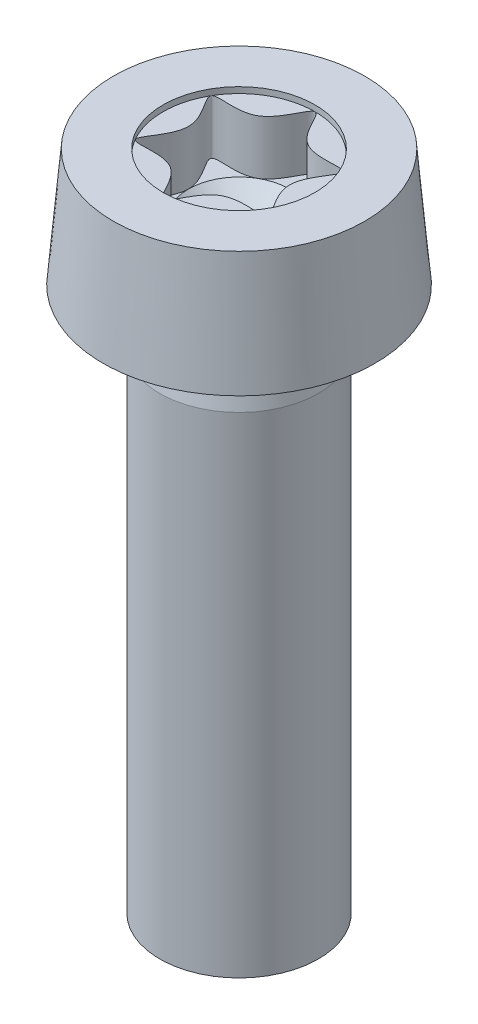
from build123d import *

# Parameters (mm, degrees)
FILLET1_R                 = 0.1
SOCKET_CUT_EXTRUDE1_DEPTH = 1.33
SKETCH3_R                 = 1.675
SOCKET_CUT_EXTRUDE2_DEPTH = 0.133


with BuildPart() as part:
    # Sketch1 → Body-Revolve (revolve)
    with BuildSketch(Plane.XY, mode=Mode.PRIVATE) as body_revolve_sk:
        Polygon((0, 14.6), (2.772529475, 14.6), (3, 12), (1.75, 12), (1.51, 12), (1.75, 10.8), (1.75, 0), (0, 0), align=None)
    revolve(body_revolve_sk.sketch.rotate(Axis((0, 0, 0), (0, 1, 0)), 90), axis=Axis((0, 0, 0), (0, 1, 0)))

    # Fillet1
    fillet1_edges = [part.edges().sort_by_distance(p)[0] for p in [
        (0, 12, 1.51),
    ]]
    fillet(fillet1_edges, radius=FILLET1_R)

    # Sketch2 → Socket-Cut-Extrude1 (cut)
    with BuildSketch(Plane(origin=(0, 14.6, 0), x_dir=(-1, 0, 0), z_dir=(0, 1, 0))):
        with BuildLine():
            add(Edge.make_bspline(
                [(0, -1.675), (-0.120421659, -1.675), (-0.361264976, -0.625729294), (-1.904940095, -1.099817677), (-0.722529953, 0), (-1.904940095, 1.099817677), (-0.361264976, 0.625729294), (0, 2.199635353), (0.361264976, 0.625729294), (1.904940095, 1.099817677), (0.722529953, 0), (1.904940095, -1.099817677), (0.361264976, -0.625729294), (0.120421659, -1.675), (0, -1.675)],
                knots=[0, 0, 0, 0, 0.083333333, 0.166666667, 0.25, 0.333333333, 0.416666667, 0.5, 0.583333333, 0.666666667, 0.75, 0.833333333, 0.916666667, 1, 1, 1, 1], degree=3))
        make_face()
    extrude(amount=-SOCKET_CUT_EXTRUDE1_DEPTH, mode=Mode.SUBTRACT)

    # Sketch3 → Socket-Cut-Extrude2 (cut)
    with BuildSketch(Plane(origin=(0, 14.6, 0), x_dir=(-1, 0, 0), z_dir=(0, 1, 0))):
        with Locations(Location((0, 0, 0), (0, 0, 90))):
            Circle(SKETCH3_R)
    extrude(amount=-SOCKET_CUT_EXTRUDE2_DEPTH, mode=Mode.SUBTRACT)

    # Sketch4 → Drill-Cut-Revolve (revolve, cut)
    with BuildSketch(Plane.XY, mode=Mode.PRIVATE) as drill_cut_revolve_sk:
        Polygon((0, 13.27), (1.116666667, 13.27), (0, 12.26), align=None)
    revolve(drill_cut_revolve_sk.sketch.rotate(Axis((0, 0, 0), (0, 1, 0)), 270), axis=Axis((0, 0, 0), (0, 1, 0)), mode=Mode.SUBTRACT)


solid = part.part
